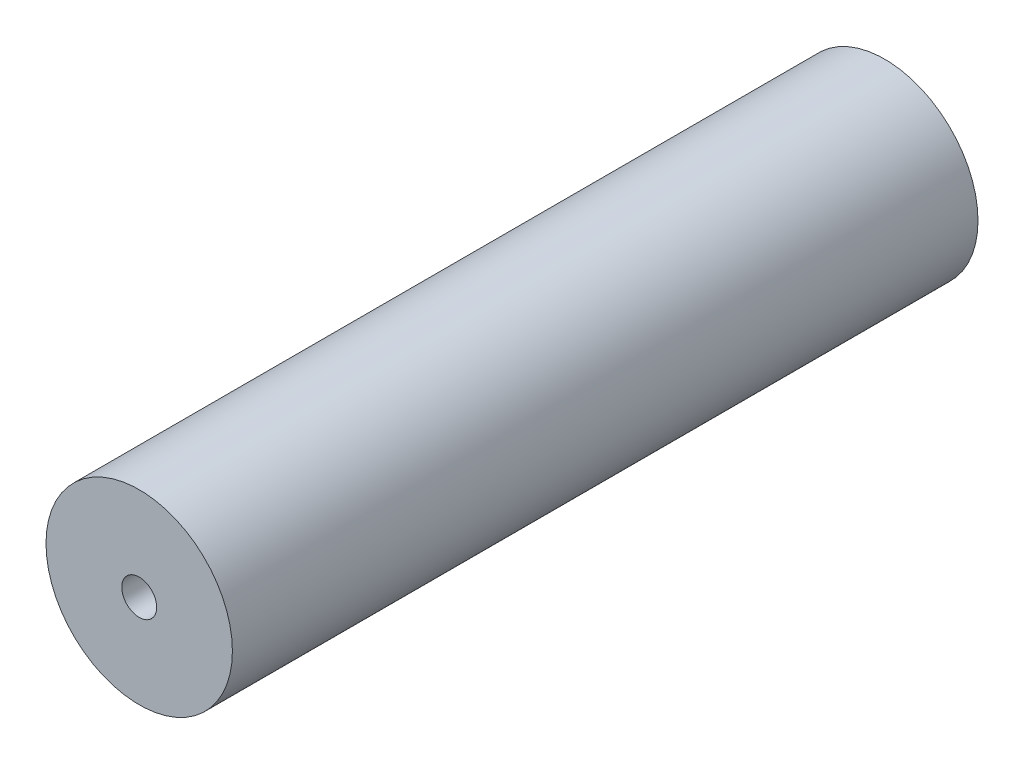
ISO-10303-21;
HEADER;
FILE_DESCRIPTION(('STEP AP214'),'2;1');
FILE_NAME('part.step','',(''),(''),'','','');
FILE_SCHEMA(('AUTOMOTIVE_DESIGN { 1 0 10303 214 1 1 1 1 }'));
ENDSEC;
DATA;
#1=APPLICATION_CONTEXT('core data for automotive mechanical design processes');
#2=APPLICATION_PROTOCOL_DEFINITION('international standard','automotive_design',2000,#1);
#3=PRODUCT_CONTEXT('',#1,'mechanical');
#4=PRODUCT('Part','Part','',(#3));
#5=PRODUCT_RELATED_PRODUCT_CATEGORY('part','',(#4));
#6=PRODUCT_DEFINITION_FORMATION('','',#4);
#7=PRODUCT_DEFINITION_CONTEXT('part definition',#1,'design');
#8=PRODUCT_DEFINITION('design','',#6,#7);
#9=PRODUCT_DEFINITION_SHAPE('','',#8);
#10=(LENGTH_UNIT() NAMED_UNIT(*) SI_UNIT(.MILLI.,.METRE.));
#11=(NAMED_UNIT(*) PLANE_ANGLE_UNIT() SI_UNIT($,.RADIAN.));
#12=(NAMED_UNIT(*) SI_UNIT($,.STERADIAN.) SOLID_ANGLE_UNIT());
#13=UNCERTAINTY_MEASURE_WITH_UNIT(LENGTH_MEASURE(1.E-05),#10,'distance_accuracy_value','');
#14=(GEOMETRIC_REPRESENTATION_CONTEXT(3) GLOBAL_UNCERTAINTY_ASSIGNED_CONTEXT((#13)) GLOBAL_UNIT_ASSIGNED_CONTEXT((#10,
#11,#12)) REPRESENTATION_CONTEXT('',''));
#15=CARTESIAN_POINT('',(0.,0.,0.));
#16=DIRECTION('',(0.,0.,1.));
#17=DIRECTION('',(1.,0.,0.));
#18=AXIS2_PLACEMENT_3D('',#15,#16,#17);
#19=CARTESIAN_POINT('',(0.,0.,203.2));
#20=DIRECTION('',(0.,0.,1.));
#21=DIRECTION('',(1.,0.,0.));
#22=AXIS2_PLACEMENT_3D('',#19,#20,#21);
#23=PLANE('',#22);
#24=CARTESIAN_POINT('',(0.,0.,203.2));
#25=DIRECTION('',(0.,0.,1.));
#26=DIRECTION('',(1.,0.,0.));
#27=AXIS2_PLACEMENT_3D('',#24,#25,#26);
#28=CIRCLE('',#27,50.8);
#29=CARTESIAN_POINT('',(50.8,0.,203.2));
#30=VERTEX_POINT('',#29);
#31=EDGE_CURVE('E10',#30,#30,#28,.T.);
#32=ORIENTED_EDGE('',*,*,#31,.T.);
#33=EDGE_LOOP('',(#32));
#34=FACE_BOUND('',#33,.T.);
#35=CARTESIAN_POINT('',(0.,0.,203.2));
#36=DIRECTION('',(0.,0.,1.));
#37=DIRECTION('',(1.,0.,0.));
#38=AXIS2_PLACEMENT_3D('',#35,#36,#37);
#39=CIRCLE('',#38,9.525);
#40=CARTESIAN_POINT('',(9.525,0.,203.2));
#41=VERTEX_POINT('',#40);
#42=EDGE_CURVE('E39',#41,#41,#39,.T.);
#43=ORIENTED_EDGE('',*,*,#42,.F.);
#44=EDGE_LOOP('',(#43));
#45=FACE_BOUND('',#44,.T.);
#46=ADVANCED_FACE('F28',(#34,#45),#23,.T.);
#47=CARTESIAN_POINT('',(0.,0.,-203.2));
#48=DIRECTION('',(0.,0.,1.));
#49=DIRECTION('',(1.,0.,0.));
#50=AXIS2_PLACEMENT_3D('',#47,#48,#49);
#51=PLANE('',#50);
#52=CARTESIAN_POINT('',(0.,0.,-203.2));
#53=DIRECTION('',(0.,0.,1.));
#54=DIRECTION('',(1.,0.,0.));
#55=AXIS2_PLACEMENT_3D('',#52,#53,#54);
#56=CIRCLE('',#55,50.8);
#57=CARTESIAN_POINT('',(50.8,0.,-203.2));
#58=VERTEX_POINT('',#57);
#59=EDGE_CURVE('E35',#58,#58,#56,.T.);
#60=ORIENTED_EDGE('',*,*,#59,.F.);
#61=EDGE_LOOP('',(#60));
#62=FACE_BOUND('',#61,.T.);
#63=CARTESIAN_POINT('',(0.,0.,-203.2));
#64=DIRECTION('',(0.,0.,1.));
#65=DIRECTION('',(1.,0.,0.));
#66=AXIS2_PLACEMENT_3D('',#63,#64,#65);
#67=CIRCLE('',#66,9.525);
#68=CARTESIAN_POINT('',(9.525,0.,-203.2));
#69=VERTEX_POINT('',#68);
#70=EDGE_CURVE('E43',#69,#69,#67,.T.);
#71=ORIENTED_EDGE('',*,*,#70,.T.);
#72=EDGE_LOOP('',(#71));
#73=FACE_BOUND('',#72,.T.);
#74=ADVANCED_FACE('F49',(#62,#73),#51,.F.);
#75=CARTESIAN_POINT('',(0.,0.,203.2));
#76=DIRECTION('',(0.,0.,-1.));
#77=DIRECTION('',(-1.,0.,0.));
#78=AXIS2_PLACEMENT_3D('',#75,#76,#77);
#79=CYLINDRICAL_SURFACE('',#78,50.8);
#80=ORIENTED_EDGE('',*,*,#31,.F.);
#81=EDGE_LOOP('',(#80));
#82=FACE_BOUND('',#81,.T.);
#83=ORIENTED_EDGE('',*,*,#59,.T.);
#84=EDGE_LOOP('',(#83));
#85=FACE_BOUND('',#84,.T.);
#86=ADVANCED_FACE('F30',(#82,#85),#79,.T.);
#87=CARTESIAN_POINT('',(0.,0.,203.2));
#88=DIRECTION('',(0.,0.,-1.));
#89=DIRECTION('',(-1.,0.,0.));
#90=AXIS2_PLACEMENT_3D('',#87,#88,#89);
#91=CYLINDRICAL_SURFACE('',#90,9.525);
#92=ORIENTED_EDGE('',*,*,#42,.T.);
#93=EDGE_LOOP('',(#92));
#94=FACE_BOUND('',#93,.T.);
#95=ORIENTED_EDGE('',*,*,#70,.F.);
#96=EDGE_LOOP('',(#95));
#97=FACE_BOUND('',#96,.T.);
#98=ADVANCED_FACE('F51',(#94,#97),#91,.F.);
#99=CLOSED_SHELL('',(#46,#74,#86,#98));
#100=MANIFOLD_SOLID_BREP('B2',#99);
#101=ADVANCED_BREP_SHAPE_REPRESENTATION('',(#18,#100),#14);
#102=SHAPE_DEFINITION_REPRESENTATION(#9,#101);
ENDSEC;
END-ISO-10303-21;
